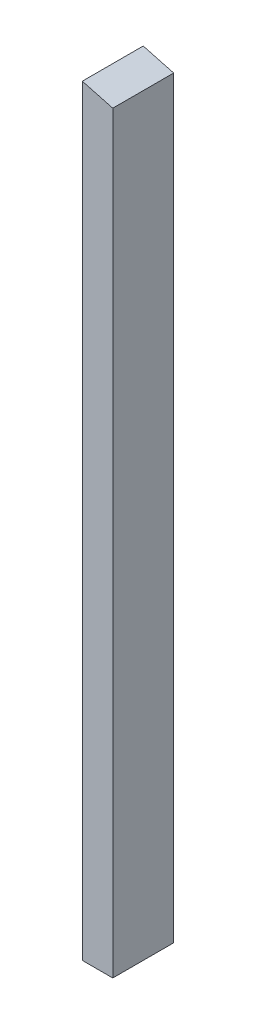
ISO-10303-21;
HEADER;
FILE_DESCRIPTION(('STEP AP214'),'2;1');
FILE_NAME('part.step','',(''),(''),'','','');
FILE_SCHEMA(('AUTOMOTIVE_DESIGN { 1 0 10303 214 1 1 1 1 }'));
ENDSEC;
DATA;
#1=APPLICATION_CONTEXT('core data for automotive mechanical design processes');
#2=APPLICATION_PROTOCOL_DEFINITION('international standard','automotive_design',2000,#1);
#3=PRODUCT_CONTEXT('',#1,'mechanical');
#4=PRODUCT('Part','Part','',(#3));
#5=PRODUCT_RELATED_PRODUCT_CATEGORY('part','',(#4));
#6=PRODUCT_DEFINITION_FORMATION('','',#4);
#7=PRODUCT_DEFINITION_CONTEXT('part definition',#1,'design');
#8=PRODUCT_DEFINITION('design','',#6,#7);
#9=PRODUCT_DEFINITION_SHAPE('','',#8);
#10=(LENGTH_UNIT() NAMED_UNIT(*) SI_UNIT(.MILLI.,.METRE.));
#11=(NAMED_UNIT(*) PLANE_ANGLE_UNIT() SI_UNIT($,.RADIAN.));
#12=(NAMED_UNIT(*) SI_UNIT($,.STERADIAN.) SOLID_ANGLE_UNIT());
#13=UNCERTAINTY_MEASURE_WITH_UNIT(LENGTH_MEASURE(1.E-05),#10,'distance_accuracy_value','');
#14=(GEOMETRIC_REPRESENTATION_CONTEXT(3) GLOBAL_UNCERTAINTY_ASSIGNED_CONTEXT((#13)) GLOBAL_UNIT_ASSIGNED_CONTEXT((#10,
#11,#12)) REPRESENTATION_CONTEXT('',''));
#15=CARTESIAN_POINT('',(0.,0.,0.));
#16=DIRECTION('',(0.,0.,1.));
#17=DIRECTION('',(1.,0.,0.));
#18=AXIS2_PLACEMENT_3D('',#15,#16,#17);
#19=CARTESIAN_POINT('',(2539.88097263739,2786.4066057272,-80.));
#20=DIRECTION('',(0.,-1.,0.));
#21=DIRECTION('',(0.,0.,-1.));
#22=AXIS2_PLACEMENT_3D('',#19,#20,#21);
#23=PLANE('',#22);
#24=DIRECTION('',(1.,0.,0.));
#25=VECTOR('',#24,1.);
#26=CARTESIAN_POINT('',(2539.88097263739,2786.4066057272,0.));
#27=LINE('',#26,#25);
#28=CARTESIAN_POINT('',(2499.88097263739,2786.4066057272,0.));
#29=VERTEX_POINT('',#28);
#30=CARTESIAN_POINT('',(2539.88097263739,2786.4066057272,0.));
#31=VERTEX_POINT('',#30);
#32=EDGE_CURVE('E130',#29,#31,#27,.T.);
#33=ORIENTED_EDGE('',*,*,#32,.F.);
#34=DIRECTION('',(0.,0.,1.));
#35=VECTOR('',#34,1.);
#36=CARTESIAN_POINT('',(2499.88097263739,2786.4066057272,-80.));
#37=LINE('',#36,#35);
#38=CARTESIAN_POINT('',(2499.88097263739,2786.4066057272,-80.));
#39=VERTEX_POINT('',#38);
#40=EDGE_CURVE('E28',#39,#29,#37,.T.);
#41=ORIENTED_EDGE('',*,*,#40,.F.);
#42=DIRECTION('',(1.,0.,0.));
#43=VECTOR('',#42,1.);
#44=CARTESIAN_POINT('',(2539.88097263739,2786.4066057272,-80.));
#45=LINE('',#44,#43);
#46=CARTESIAN_POINT('',(2539.88097263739,2786.4066057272,-80.));
#47=VERTEX_POINT('',#46);
#48=EDGE_CURVE('E141',#39,#47,#45,.T.);
#49=ORIENTED_EDGE('',*,*,#48,.T.);
#50=DIRECTION('',(0.,0.,1.));
#51=VECTOR('',#50,1.);
#52=CARTESIAN_POINT('',(2539.88097263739,2786.4066057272,-80.));
#53=LINE('',#52,#51);
#54=EDGE_CURVE('E150',#47,#31,#53,.T.);
#55=ORIENTED_EDGE('',*,*,#54,.T.);
#56=EDGE_LOOP('',(#33,#41,#49,#55));
#57=FACE_BOUND('',#56,.T.);
#58=DIRECTION('',(0.,0.,1.));
#59=VECTOR('',#58,1.);
#60=CARTESIAN_POINT('',(2502.88097263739,2786.4066057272,-80.));
#61=LINE('',#60,#59);
#62=CARTESIAN_POINT('',(2502.88097263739,2786.4066057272,-77.));
#63=VERTEX_POINT('',#62);
#64=CARTESIAN_POINT('',(2502.88097263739,2786.4066057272,-3.));
#65=VERTEX_POINT('',#64);
#66=EDGE_CURVE('E108',#63,#65,#61,.T.);
#67=ORIENTED_EDGE('',*,*,#66,.T.);
#68=DIRECTION('',(1.,0.,0.));
#69=VECTOR('',#68,1.);
#70=CARTESIAN_POINT('',(2499.88097263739,2786.4066057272,-3.));
#71=LINE('',#70,#69);
#72=CARTESIAN_POINT('',(2536.88097263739,2786.4066057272,-3.));
#73=VERTEX_POINT('',#72);
#74=EDGE_CURVE('E121',#65,#73,#71,.T.);
#75=ORIENTED_EDGE('',*,*,#74,.T.);
#76=DIRECTION('',(0.,0.,1.));
#77=VECTOR('',#76,1.);
#78=CARTESIAN_POINT('',(2536.88097263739,2786.4066057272,-80.));
#79=LINE('',#78,#77);
#80=CARTESIAN_POINT('',(2536.88097263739,2786.4066057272,-77.));
#81=VERTEX_POINT('',#80);
#82=EDGE_CURVE('E113',#81,#73,#79,.T.);
#83=ORIENTED_EDGE('',*,*,#82,.F.);
#84=DIRECTION('',(1.,0.,0.));
#85=VECTOR('',#84,1.);
#86=CARTESIAN_POINT('',(2499.88097263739,2786.4066057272,-77.));
#87=LINE('',#86,#85);
#88=EDGE_CURVE('E41',#63,#81,#87,.T.);
#89=ORIENTED_EDGE('',*,*,#88,.F.);
#90=EDGE_LOOP('',(#67,#75,#83,#89));
#91=FACE_BOUND('',#90,.T.);
#92=ADVANCED_FACE('F24',(#57,#91),#23,.T.);
#93=CARTESIAN_POINT('',(2499.88097263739,2786.4066057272,-80.));
#94=DIRECTION('',(-1.,0.,0.));
#95=DIRECTION('',(0.,0.,1.));
#96=AXIS2_PLACEMENT_3D('',#93,#94,#95);
#97=PLANE('',#96);
#98=DIRECTION('',(0.,-1.,0.));
#99=VECTOR('',#98,1.);
#100=CARTESIAN_POINT('',(2499.88097263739,2786.4066057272,0.));
#101=LINE('',#100,#99);
#102=CARTESIAN_POINT('',(2499.88097263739,3786.4066057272,0.));
#103=VERTEX_POINT('',#102);
#104=EDGE_CURVE('E102',#103,#29,#101,.T.);
#105=ORIENTED_EDGE('',*,*,#104,.F.);
#106=DIRECTION('',(0.,0.,1.));
#107=VECTOR('',#106,1.);
#108=CARTESIAN_POINT('',(2499.88097263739,3786.4066057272,-80.));
#109=LINE('',#108,#107);
#110=CARTESIAN_POINT('',(2499.88097263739,3786.4066057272,-80.));
#111=VERTEX_POINT('',#110);
#112=EDGE_CURVE('E11',#111,#103,#109,.T.);
#113=ORIENTED_EDGE('',*,*,#112,.F.);
#114=DIRECTION('',(0.,-1.,0.));
#115=VECTOR('',#114,1.);
#116=CARTESIAN_POINT('',(2499.88097263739,2786.4066057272,-80.));
#117=LINE('',#116,#115);
#118=EDGE_CURVE('E139',#111,#39,#117,.T.);
#119=ORIENTED_EDGE('',*,*,#118,.T.);
#120=ORIENTED_EDGE('',*,*,#40,.T.);
#121=EDGE_LOOP('',(#105,#113,#119,#120));
#122=FACE_BOUND('',#121,.T.);
#123=ADVANCED_FACE('F26',(#122),#97,.T.);
#124=CARTESIAN_POINT('',(2499.88097263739,3786.4066057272,-80.));
#125=DIRECTION('',(0.258819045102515,0.96592582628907,0.));
#126=DIRECTION('',(-0.96592582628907,0.258819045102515,0.));
#127=AXIS2_PLACEMENT_3D('',#124,#125,#126);
#128=PLANE('',#127);
#129=DIRECTION('',(-0.96592582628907,0.258819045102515,0.));
#130=VECTOR('',#129,1.);
#131=CARTESIAN_POINT('',(2499.88097263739,3786.4066057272,0.));
#132=LINE('',#131,#130);
#133=CARTESIAN_POINT('',(2539.88097263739,3775.68863802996,0.));
#134=VERTEX_POINT('',#133);
#135=EDGE_CURVE('E136',#134,#103,#132,.T.);
#136=ORIENTED_EDGE('',*,*,#135,.F.);
#137=DIRECTION('',(0.,0.,1.));
#138=VECTOR('',#137,1.);
#139=CARTESIAN_POINT('',(2539.88097263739,3775.68863802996,-80.));
#140=LINE('',#139,#138);
#141=CARTESIAN_POINT('',(2539.88097263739,3775.68863802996,-80.));
#142=VERTEX_POINT('',#141);
#143=EDGE_CURVE('E33',#142,#134,#140,.T.);
#144=ORIENTED_EDGE('',*,*,#143,.F.);
#145=DIRECTION('',(-0.96592582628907,0.258819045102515,0.));
#146=VECTOR('',#145,1.);
#147=CARTESIAN_POINT('',(2499.88097263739,3786.4066057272,-80.));
#148=LINE('',#147,#146);
#149=EDGE_CURVE('E147',#142,#111,#148,.T.);
#150=ORIENTED_EDGE('',*,*,#149,.T.);
#151=ORIENTED_EDGE('',*,*,#112,.T.);
#152=EDGE_LOOP('',(#136,#144,#150,#151));
#153=FACE_BOUND('',#152,.T.);
#154=ADVANCED_FACE('F160',(#153),#128,.T.);
#155=CARTESIAN_POINT('',(2539.88097263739,3775.68863802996,-80.));
#156=DIRECTION('',(1.,0.,0.));
#157=DIRECTION('',(0.,0.,-1.));
#158=AXIS2_PLACEMENT_3D('',#155,#156,#157);
#159=PLANE('',#158);
#160=DIRECTION('',(0.,1.,0.));
#161=VECTOR('',#160,1.);
#162=CARTESIAN_POINT('',(2539.88097263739,3775.68863802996,0.));
#163=LINE('',#162,#161);
#164=EDGE_CURVE('E133',#31,#134,#163,.T.);
#165=ORIENTED_EDGE('',*,*,#164,.F.);
#166=ORIENTED_EDGE('',*,*,#54,.F.);
#167=DIRECTION('',(0.,1.,0.));
#168=VECTOR('',#167,1.);
#169=CARTESIAN_POINT('',(2539.88097263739,3775.68863802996,-80.));
#170=LINE('',#169,#168);
#171=EDGE_CURVE('E144',#47,#142,#170,.T.);
#172=ORIENTED_EDGE('',*,*,#171,.T.);
#173=ORIENTED_EDGE('',*,*,#143,.T.);
#174=EDGE_LOOP('',(#165,#166,#172,#173));
#175=FACE_BOUND('',#174,.T.);
#176=ADVANCED_FACE('F166',(#175),#159,.T.);
#177=CARTESIAN_POINT('',(2499.88097263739,2786.4066057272,-80.));
#178=DIRECTION('',(0.,0.,1.));
#179=DIRECTION('',(1.,0.,0.));
#180=AXIS2_PLACEMENT_3D('',#177,#178,#179);
#181=PLANE('',#180);
#182=ORIENTED_EDGE('',*,*,#118,.F.);
#183=ORIENTED_EDGE('',*,*,#149,.F.);
#184=ORIENTED_EDGE('',*,*,#171,.F.);
#185=ORIENTED_EDGE('',*,*,#48,.F.);
#186=EDGE_LOOP('',(#182,#183,#184,#185));
#187=FACE_BOUND('',#186,.T.);
#188=ADVANCED_FACE('F164',(#187),#181,.F.);
#189=CARTESIAN_POINT('',(2499.88097263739,2786.4066057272,0.));
#190=DIRECTION('',(0.,0.,1.));
#191=DIRECTION('',(1.,0.,0.));
#192=AXIS2_PLACEMENT_3D('',#189,#190,#191);
#193=PLANE('',#192);
#194=ORIENTED_EDGE('',*,*,#104,.T.);
#195=ORIENTED_EDGE('',*,*,#32,.T.);
#196=ORIENTED_EDGE('',*,*,#164,.T.);
#197=ORIENTED_EDGE('',*,*,#135,.T.);
#198=EDGE_LOOP('',(#194,#195,#196,#197));
#199=FACE_BOUND('',#198,.T.);
#200=ADVANCED_FACE('F157',(#199),#193,.T.);
#201=CARTESIAN_POINT('',(2502.88097263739,2786.4066057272,-80.));
#202=DIRECTION('',(-1.,0.,0.));
#203=DIRECTION('',(0.,0.,1.));
#204=AXIS2_PLACEMENT_3D('',#201,#202,#203);
#205=PLANE('',#204);
#206=DIRECTION('',(0.,-1.,0.));
#207=VECTOR('',#206,1.);
#208=CARTESIAN_POINT('',(2502.88097263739,2786.4066057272,-3.));
#209=LINE('',#208,#207);
#210=CARTESIAN_POINT('',(2502.88097263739,3782.49692960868,-3.));
#211=VERTEX_POINT('',#210);
#212=EDGE_CURVE('E127',#211,#65,#209,.T.);
#213=ORIENTED_EDGE('',*,*,#212,.T.);
#214=ORIENTED_EDGE('',*,*,#66,.F.);
#215=DIRECTION('',(0.,-1.,0.));
#216=VECTOR('',#215,1.);
#217=CARTESIAN_POINT('',(2502.88097263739,2786.4066057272,-77.));
#218=LINE('',#217,#216);
#219=CARTESIAN_POINT('',(2502.88097263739,3782.49692960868,-77.));
#220=VERTEX_POINT('',#219);
#221=EDGE_CURVE('E105',#220,#63,#218,.T.);
#222=ORIENTED_EDGE('',*,*,#221,.F.);
#223=DIRECTION('',(0.,0.,1.));
#224=VECTOR('',#223,1.);
#225=CARTESIAN_POINT('',(2502.88097263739,3782.49692960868,-80.));
#226=LINE('',#225,#224);
#227=EDGE_CURVE('E92',#220,#211,#226,.T.);
#228=ORIENTED_EDGE('',*,*,#227,.T.);
#229=EDGE_LOOP('',(#213,#214,#222,#228));
#230=FACE_BOUND('',#229,.T.);
#231=ADVANCED_FACE('F106',(#230),#205,.F.);
#232=CARTESIAN_POINT('',(2499.10451550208,3783.50882824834,-80.));
#233=DIRECTION('',(0.258819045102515,0.96592582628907,0.));
#234=DIRECTION('',(-0.96592582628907,0.258819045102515,0.));
#235=AXIS2_PLACEMENT_3D('',#232,#233,#234);
#236=PLANE('',#235);
#237=DIRECTION('',(-0.96592582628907,0.258819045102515,0.));
#238=VECTOR('',#237,1.);
#239=CARTESIAN_POINT('',(2749.10451550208,3716.52153014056,-3.));
#240=LINE('',#239,#238);
#241=CARTESIAN_POINT('',(2536.88097263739,3773.38665706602,-3.));
#242=VERTEX_POINT('',#241);
#243=EDGE_CURVE('E98',#242,#211,#240,.T.);
#244=ORIENTED_EDGE('',*,*,#243,.T.);
#245=ORIENTED_EDGE('',*,*,#227,.F.);
#246=DIRECTION('',(-0.96592582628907,0.258819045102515,0.));
#247=VECTOR('',#246,1.);
#248=CARTESIAN_POINT('',(2749.10451550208,3716.52153014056,-77.));
#249=LINE('',#248,#247);
#250=CARTESIAN_POINT('',(2536.88097263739,3773.38665706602,-77.));
#251=VERTEX_POINT('',#250);
#252=EDGE_CURVE('E96',#251,#220,#249,.T.);
#253=ORIENTED_EDGE('',*,*,#252,.F.);
#254=DIRECTION('',(0.,0.,1.));
#255=VECTOR('',#254,1.);
#256=CARTESIAN_POINT('',(2536.88097263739,3773.38665706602,-80.));
#257=LINE('',#256,#255);
#258=EDGE_CURVE('E103',#251,#242,#257,.T.);
#259=ORIENTED_EDGE('',*,*,#258,.T.);
#260=EDGE_LOOP('',(#244,#245,#253,#259));
#261=FACE_BOUND('',#260,.T.);
#262=ADVANCED_FACE('F94',(#261),#236,.F.);
#263=CARTESIAN_POINT('',(2536.88097263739,3775.68863802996,-80.));
#264=DIRECTION('',(1.,0.,0.));
#265=DIRECTION('',(0.,0.,-1.));
#266=AXIS2_PLACEMENT_3D('',#263,#264,#265);
#267=PLANE('',#266);
#268=DIRECTION('',(0.,1.,0.));
#269=VECTOR('',#268,1.);
#270=CARTESIAN_POINT('',(2536.88097263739,2786.4066057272,-3.));
#271=LINE('',#270,#269);
#272=EDGE_CURVE('E119',#73,#242,#271,.T.);
#273=ORIENTED_EDGE('',*,*,#272,.T.);
#274=ORIENTED_EDGE('',*,*,#258,.F.);
#275=DIRECTION('',(0.,1.,0.));
#276=VECTOR('',#275,1.);
#277=CARTESIAN_POINT('',(2536.88097263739,2786.4066057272,-77.));
#278=LINE('',#277,#276);
#279=EDGE_CURVE('E111',#81,#251,#278,.T.);
#280=ORIENTED_EDGE('',*,*,#279,.F.);
#281=ORIENTED_EDGE('',*,*,#82,.T.);
#282=EDGE_LOOP('',(#273,#274,#280,#281));
#283=FACE_BOUND('',#282,.T.);
#284=ADVANCED_FACE('F212',(#283),#267,.F.);
#285=CARTESIAN_POINT('',(2499.88097263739,2786.4066057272,-77.));
#286=DIRECTION('',(0.,0.,1.));
#287=DIRECTION('',(1.,0.,0.));
#288=AXIS2_PLACEMENT_3D('',#285,#286,#287);
#289=PLANE('',#288);
#290=ORIENTED_EDGE('',*,*,#221,.T.);
#291=ORIENTED_EDGE('',*,*,#88,.T.);
#292=ORIENTED_EDGE('',*,*,#279,.T.);
#293=ORIENTED_EDGE('',*,*,#252,.T.);
#294=EDGE_LOOP('',(#290,#291,#292,#293));
#295=FACE_BOUND('',#294,.T.);
#296=ADVANCED_FACE('F110',(#295),#289,.T.);
#297=CARTESIAN_POINT('',(2499.88097263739,2786.4066057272,-3.));
#298=DIRECTION('',(0.,0.,1.));
#299=DIRECTION('',(1.,0.,0.));
#300=AXIS2_PLACEMENT_3D('',#297,#298,#299);
#301=PLANE('',#300);
#302=ORIENTED_EDGE('',*,*,#212,.F.);
#303=ORIENTED_EDGE('',*,*,#243,.F.);
#304=ORIENTED_EDGE('',*,*,#272,.F.);
#305=ORIENTED_EDGE('',*,*,#74,.F.);
#306=EDGE_LOOP('',(#302,#303,#304,#305));
#307=FACE_BOUND('',#306,.T.);
#308=ADVANCED_FACE('F226',(#307),#301,.F.);
#309=CLOSED_SHELL('',(#92,#123,#154,#176,#188,#200,#231,#262,#284,#296,#308));
#310=MANIFOLD_SOLID_BREP('B2',#309);
#311=ADVANCED_BREP_SHAPE_REPRESENTATION('',(#18,#310),#14);
#312=SHAPE_DEFINITION_REPRESENTATION(#9,#311);
ENDSEC;
END-ISO-10303-21;
